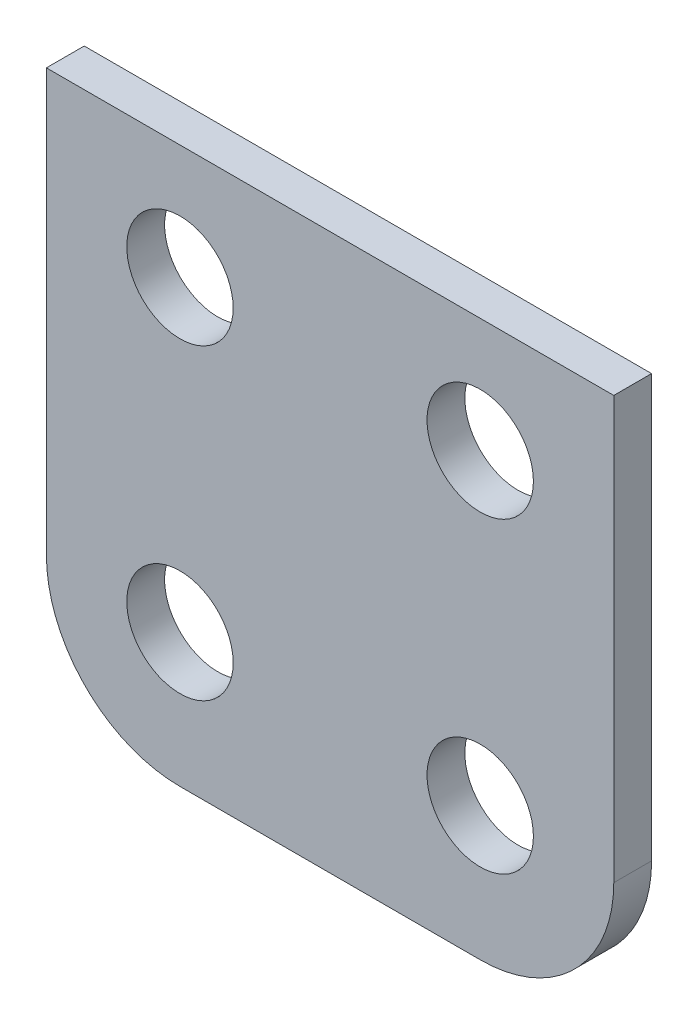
from build123d import *

# Parameters (mm, degrees)
LINEAR_AUSTRAGEN1_DEPTH          = 1.6
F_4_5_4_5_DURCHMESSER_BOHRUNG1_D = 4.5


with BuildPart() as part:
    # Skizze1 → Linear austragen1 (new body)
    with BuildSketch(Plane.XY):
        with BuildLine():
            Line((5.65, 0), (18.35, 0))
            ThreePointArc((18.35, 0), (22.345153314, 1.654846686), (24, 5.65))
            Line((24, 5.65), (24, 23.5))
            Line((24, 23.5), (0, 23.5))
            Line((0, 23.5), (0, 5.65))
            ThreePointArc((0, 5.65), (1.654846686, 1.654846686), (5.65, 0))
        make_face()
    extrude(amount=LINEAR_AUSTRAGEN1_DEPTH)

    # 4.5 _4.5_ Durchmesser Bohrung1 (through all)
    with Locations(Plane(origin=(5.65, 5.65, 1.6), x_dir=(1, 0, 0), z_dir=(0, 0, 1))):
        with Locations((0, 0), (12.7, 0), (12.7, 13), (0, 13)):
            Hole(F_4_5_4_5_DURCHMESSER_BOHRUNG1_D / 2)


solid = part.part
